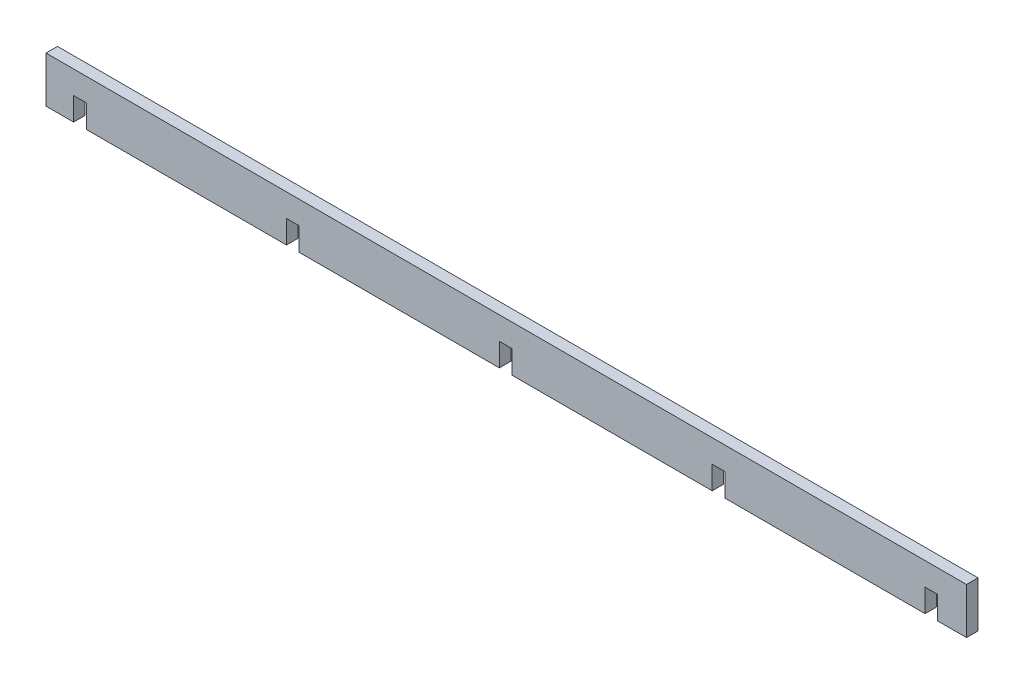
ISO-10303-21;
HEADER;
FILE_DESCRIPTION(('STEP AP214'),'2;1');
FILE_NAME('part.step','',(''),(''),'','','');
FILE_SCHEMA(('AUTOMOTIVE_DESIGN { 1 0 10303 214 1 1 1 1 }'));
ENDSEC;
DATA;
#1=APPLICATION_CONTEXT('core data for automotive mechanical design processes');
#2=APPLICATION_PROTOCOL_DEFINITION('international standard','automotive_design',2000,#1);
#3=PRODUCT_CONTEXT('',#1,'mechanical');
#4=PRODUCT('Part','Part','',(#3));
#5=PRODUCT_RELATED_PRODUCT_CATEGORY('part','',(#4));
#6=PRODUCT_DEFINITION_FORMATION('','',#4);
#7=PRODUCT_DEFINITION_CONTEXT('part definition',#1,'design');
#8=PRODUCT_DEFINITION('design','',#6,#7);
#9=PRODUCT_DEFINITION_SHAPE('','',#8);
#10=(LENGTH_UNIT() NAMED_UNIT(*) SI_UNIT(.MILLI.,.METRE.));
#11=(NAMED_UNIT(*) PLANE_ANGLE_UNIT() SI_UNIT($,.RADIAN.));
#12=(NAMED_UNIT(*) SI_UNIT($,.STERADIAN.) SOLID_ANGLE_UNIT());
#13=UNCERTAINTY_MEASURE_WITH_UNIT(LENGTH_MEASURE(1.E-05),#10,'distance_accuracy_value','');
#14=(GEOMETRIC_REPRESENTATION_CONTEXT(3) GLOBAL_UNCERTAINTY_ASSIGNED_CONTEXT((#13)) GLOBAL_UNIT_ASSIGNED_CONTEXT((#10,
#11,#12)) REPRESENTATION_CONTEXT('',''));
#15=CARTESIAN_POINT('',(0.,0.,0.));
#16=DIRECTION('',(0.,0.,1.));
#17=DIRECTION('',(1.,0.,0.));
#18=AXIS2_PLACEMENT_3D('',#15,#16,#17);
#19=CARTESIAN_POINT('',(0.,0.,10.));
#20=DIRECTION('',(0.,1.,0.));
#21=DIRECTION('',(0.,0.,1.));
#22=AXIS2_PLACEMENT_3D('',#19,#20,#21);
#23=PLANE('',#22);
#24=DIRECTION('',(0.,0.,-1.));
#25=VECTOR('',#24,1.);
#26=CARTESIAN_POINT('',(1180.,0.,10.001));
#27=LINE('',#26,#25);
#28=CARTESIAN_POINT('',(1180.,0.,10.));
#29=VERTEX_POINT('',#28);
#30=CARTESIAN_POINT('',(1180.,0.,-10.));
#31=VERTEX_POINT('',#30);
#32=EDGE_CURVE('E198',#29,#31,#27,.T.);
#33=ORIENTED_EDGE('',*,*,#32,.T.);
#34=DIRECTION('',(1.,0.,0.));
#35=VECTOR('',#34,1.);
#36=CARTESIAN_POINT('',(0.,0.,-10.));
#37=LINE('',#36,#35);
#38=CARTESIAN_POINT('',(1528.,0.,-10.));
#39=VERTEX_POINT('',#38);
#40=EDGE_CURVE('E212',#31,#39,#37,.T.);
#41=ORIENTED_EDGE('',*,*,#40,.T.);
#42=DIRECTION('',(0.,0.,-1.));
#43=VECTOR('',#42,1.);
#44=CARTESIAN_POINT('',(1528.,0.,10.001));
#45=LINE('',#44,#43);
#46=CARTESIAN_POINT('',(1528.,0.,10.));
#47=VERTEX_POINT('',#46);
#48=EDGE_CURVE('E316',#47,#39,#45,.T.);
#49=ORIENTED_EDGE('',*,*,#48,.F.);
#50=DIRECTION('',(1.,0.,0.));
#51=VECTOR('',#50,1.);
#52=CARTESIAN_POINT('',(0.,0.,10.));
#53=LINE('',#52,#51);
#54=EDGE_CURVE('E214',#29,#47,#53,.T.);
#55=ORIENTED_EDGE('',*,*,#54,.F.);
#56=EDGE_LOOP('',(#33,#41,#49,#55));
#57=FACE_BOUND('',#56,.T.);
#58=ADVANCED_FACE('F33',(#57),#23,.F.);
#59=DIRECTION('',(0.,0.,-1.));
#60=VECTOR('',#59,1.);
#61=CARTESIAN_POINT('',(1158.,0.,10.001));
#62=LINE('',#61,#60);
#63=CARTESIAN_POINT('',(1158.,0.,10.));
#64=VERTEX_POINT('',#63);
#65=CARTESIAN_POINT('',(1158.,0.,-10.));
#66=VERTEX_POINT('',#65);
#67=EDGE_CURVE('E48',#64,#66,#62,.T.);
#68=ORIENTED_EDGE('',*,*,#67,.F.);
#69=CARTESIAN_POINT('',(810.,0.,10.));
#70=VERTEX_POINT('',#69);
#71=EDGE_CURVE('E442',#70,#64,#53,.T.);
#72=ORIENTED_EDGE('',*,*,#71,.F.);
#73=DIRECTION('',(0.,0.,-1.));
#74=VECTOR('',#73,1.);
#75=CARTESIAN_POINT('',(810.,0.,10.001));
#76=LINE('',#75,#74);
#77=CARTESIAN_POINT('',(810.,0.,-10.));
#78=VERTEX_POINT('',#77);
#79=EDGE_CURVE('E276',#70,#78,#76,.T.);
#80=ORIENTED_EDGE('',*,*,#79,.T.);
#81=EDGE_CURVE('E222',#78,#66,#37,.T.);
#82=ORIENTED_EDGE('',*,*,#81,.T.);
#83=EDGE_LOOP('',(#68,#72,#80,#82));
#84=FACE_BOUND('',#83,.T.);
#85=ADVANCED_FACE('F419',(#84),#23,.F.);
#86=CARTESIAN_POINT('',(0.,0.,10.));
#87=DIRECTION('',(0.,0.,-1.));
#88=DIRECTION('',(-1.,0.,0.));
#89=AXIS2_PLACEMENT_3D('',#86,#87,#88);
#90=PLANE('',#89);
#91=DIRECTION('',(0.,-1.,0.));
#92=VECTOR('',#91,1.);
#93=CARTESIAN_POINT('',(1180.,0.,10.));
#94=LINE('',#93,#92);
#95=CARTESIAN_POINT('',(1180.,40.,10.));
#96=VERTEX_POINT('',#95);
#97=EDGE_CURVE('E449',#96,#29,#94,.T.);
#98=ORIENTED_EDGE('',*,*,#97,.T.);
#99=ORIENTED_EDGE('',*,*,#54,.T.);
#100=DIRECTION('',(0.,1.,0.));
#101=VECTOR('',#100,1.);
#102=CARTESIAN_POINT('',(1528.,0.,10.));
#103=LINE('',#102,#101);
#104=CARTESIAN_POINT('',(1528.,40.,10.));
#105=VERTEX_POINT('',#104);
#106=EDGE_CURVE('E325',#47,#105,#103,.T.);
#107=ORIENTED_EDGE('',*,*,#106,.T.);
#108=DIRECTION('',(1.,0.,0.));
#109=VECTOR('',#108,1.);
#110=CARTESIAN_POINT('',(1528.,40.,10.));
#111=LINE('',#110,#109);
#112=CARTESIAN_POINT('',(1550.,40.,10.));
#113=VERTEX_POINT('',#112);
#114=EDGE_CURVE('E310',#105,#113,#111,.T.);
#115=ORIENTED_EDGE('',*,*,#114,.T.);
#116=DIRECTION('',(0.,-1.,0.));
#117=VECTOR('',#116,1.);
#118=CARTESIAN_POINT('',(1550.,0.,10.));
#119=LINE('',#118,#117);
#120=CARTESIAN_POINT('',(1550.,0.,10.));
#121=VERTEX_POINT('',#120);
#122=EDGE_CURVE('E313',#113,#121,#119,.T.);
#123=ORIENTED_EDGE('',*,*,#122,.T.);
#124=CARTESIAN_POINT('',(1600.,0.,10.));
#125=VERTEX_POINT('',#124);
#126=EDGE_CURVE('E358',#121,#125,#53,.T.);
#127=ORIENTED_EDGE('',*,*,#126,.T.);
#128=DIRECTION('',(0.,1.,0.));
#129=VECTOR('',#128,1.);
#130=CARTESIAN_POINT('',(1600.,0.,10.));
#131=LINE('',#130,#129);
#132=CARTESIAN_POINT('',(1600.,80.,10.));
#133=VERTEX_POINT('',#132);
#134=EDGE_CURVE('E362',#125,#133,#131,.T.);
#135=ORIENTED_EDGE('',*,*,#134,.T.);
#136=DIRECTION('',(-1.,0.,0.));
#137=VECTOR('',#136,1.);
#138=CARTESIAN_POINT('',(0.,80.,10.));
#139=LINE('',#138,#137);
#140=CARTESIAN_POINT('',(0.,80.,10.));
#141=VERTEX_POINT('',#140);
#142=EDGE_CURVE('E365',#133,#141,#139,.T.);
#143=ORIENTED_EDGE('',*,*,#142,.T.);
#144=DIRECTION('',(0.,-1.,0.));
#145=VECTOR('',#144,1.);
#146=CARTESIAN_POINT('',(0.,0.,10.));
#147=LINE('',#146,#145);
#148=CARTESIAN_POINT('',(0.,0.,10.));
#149=VERTEX_POINT('',#148);
#150=EDGE_CURVE('E355',#141,#149,#147,.T.);
#151=ORIENTED_EDGE('',*,*,#150,.T.);
#152=CARTESIAN_POINT('',(48.0000000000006,0.,10.));
#153=VERTEX_POINT('',#152);
#154=EDGE_CURVE('E359',#149,#153,#53,.T.);
#155=ORIENTED_EDGE('',*,*,#154,.T.);
#156=DIRECTION('',(0.,1.,0.));
#157=VECTOR('',#156,1.);
#158=CARTESIAN_POINT('',(48.0000000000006,0.,10.));
#159=LINE('',#158,#157);
#160=CARTESIAN_POINT('',(48.0000000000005,40.,10.));
#161=VERTEX_POINT('',#160);
#162=EDGE_CURVE('E340',#153,#161,#159,.T.);
#163=ORIENTED_EDGE('',*,*,#162,.T.);
#164=DIRECTION('',(1.,0.,0.));
#165=VECTOR('',#164,1.);
#166=CARTESIAN_POINT('',(48.0000000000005,40.,10.));
#167=LINE('',#166,#165);
#168=CARTESIAN_POINT('',(70.0000000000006,40.,10.));
#169=VERTEX_POINT('',#168);
#170=EDGE_CURVE('E352',#161,#169,#167,.T.);
#171=ORIENTED_EDGE('',*,*,#170,.T.);
#172=DIRECTION('',(0.,-1.,0.));
#173=VECTOR('',#172,1.);
#174=CARTESIAN_POINT('',(70.0000000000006,0.,10.));
#175=LINE('',#174,#173);
#176=CARTESIAN_POINT('',(70.0000000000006,0.,10.));
#177=VERTEX_POINT('',#176);
#178=EDGE_CURVE('E337',#169,#177,#175,.T.);
#179=ORIENTED_EDGE('',*,*,#178,.T.);
#180=CARTESIAN_POINT('',(418.,0.,10.));
#181=VERTEX_POINT('',#180);
#182=EDGE_CURVE('E363',#177,#181,#53,.T.);
#183=ORIENTED_EDGE('',*,*,#182,.T.);
#184=DIRECTION('',(0.,1.,0.));
#185=VECTOR('',#184,1.);
#186=CARTESIAN_POINT('',(418.,0.,10.));
#187=LINE('',#186,#185);
#188=CARTESIAN_POINT('',(418.,40.,10.));
#189=VERTEX_POINT('',#188);
#190=EDGE_CURVE('E301',#181,#189,#187,.T.);
#191=ORIENTED_EDGE('',*,*,#190,.T.);
#192=DIRECTION('',(1.,0.,0.));
#193=VECTOR('',#192,1.);
#194=CARTESIAN_POINT('',(418.,40.,10.));
#195=LINE('',#194,#193);
#196=CARTESIAN_POINT('',(440.,40.,10.));
#197=VERTEX_POINT('',#196);
#198=EDGE_CURVE('E288',#189,#197,#195,.T.);
#199=ORIENTED_EDGE('',*,*,#198,.T.);
#200=DIRECTION('',(0.,-1.,0.));
#201=VECTOR('',#200,1.);
#202=CARTESIAN_POINT('',(440.,0.,10.));
#203=LINE('',#202,#201);
#204=CARTESIAN_POINT('',(440.,0.,10.));
#205=VERTEX_POINT('',#204);
#206=EDGE_CURVE('E291',#197,#205,#203,.T.);
#207=ORIENTED_EDGE('',*,*,#206,.T.);
#208=CARTESIAN_POINT('',(788.,0.,10.));
#209=VERTEX_POINT('',#208);
#210=EDGE_CURVE('E441',#205,#209,#53,.T.);
#211=ORIENTED_EDGE('',*,*,#210,.T.);
#212=DIRECTION('',(0.,1.,0.));
#213=VECTOR('',#212,1.);
#214=CARTESIAN_POINT('',(788.,0.,10.));
#215=LINE('',#214,#213);
#216=CARTESIAN_POINT('',(788.,40.,10.));
#217=VERTEX_POINT('',#216);
#218=EDGE_CURVE('E279',#209,#217,#215,.T.);
#219=ORIENTED_EDGE('',*,*,#218,.T.);
#220=DIRECTION('',(1.,0.,0.));
#221=VECTOR('',#220,1.);
#222=CARTESIAN_POINT('',(788.,40.,10.));
#223=LINE('',#222,#221);
#224=CARTESIAN_POINT('',(810.,40.,10.));
#225=VERTEX_POINT('',#224);
#226=EDGE_CURVE('E261',#217,#225,#223,.T.);
#227=ORIENTED_EDGE('',*,*,#226,.T.);
#228=DIRECTION('',(0.,-1.,0.));
#229=VECTOR('',#228,1.);
#230=CARTESIAN_POINT('',(810.,0.,10.));
#231=LINE('',#230,#229);
#232=EDGE_CURVE('E268',#225,#70,#231,.T.);
#233=ORIENTED_EDGE('',*,*,#232,.T.);
#234=ORIENTED_EDGE('',*,*,#71,.T.);
#235=DIRECTION('',(0.,1.,0.));
#236=VECTOR('',#235,1.);
#237=CARTESIAN_POINT('',(1158.,0.,10.));
#238=LINE('',#237,#236);
#239=CARTESIAN_POINT('',(1158.,40.,10.));
#240=VERTEX_POINT('',#239);
#241=EDGE_CURVE('E215',#64,#240,#238,.T.);
#242=ORIENTED_EDGE('',*,*,#241,.T.);
#243=DIRECTION('',(1.,0.,0.));
#244=VECTOR('',#243,1.);
#245=CARTESIAN_POINT('',(1158.,40.,10.));
#246=LINE('',#245,#244);
#247=EDGE_CURVE('E206',#240,#96,#246,.T.);
#248=ORIENTED_EDGE('',*,*,#247,.T.);
#249=EDGE_LOOP('',(#98,#99,#107,#115,#123,#127,#135,#143,#151,#155,#163,#171,#179,#183,#191,
#199,#207,#211,#219,#227,#233,#234,#242,#248));
#250=FACE_BOUND('',#249,.T.);
#251=ADVANCED_FACE('F378',(#250),#90,.F.);
#252=CARTESIAN_POINT('',(0.,0.,-10.));
#253=DIRECTION('',(0.,0.,-1.));
#254=DIRECTION('',(-1.,0.,0.));
#255=AXIS2_PLACEMENT_3D('',#252,#253,#254);
#256=PLANE('',#255);
#257=ORIENTED_EDGE('',*,*,#40,.F.);
#258=DIRECTION('',(0.,1.,0.));
#259=VECTOR('',#258,1.);
#260=CARTESIAN_POINT('',(1180.,0.,-10.));
#261=LINE('',#260,#259);
#262=CARTESIAN_POINT('',(1180.,40.,-10.));
#263=VERTEX_POINT('',#262);
#264=EDGE_CURVE('E195',#31,#263,#261,.T.);
#265=ORIENTED_EDGE('',*,*,#264,.T.);
#266=DIRECTION('',(-1.,0.,0.));
#267=VECTOR('',#266,1.);
#268=CARTESIAN_POINT('',(1158.,40.,-10.));
#269=LINE('',#268,#267);
#270=CARTESIAN_POINT('',(1158.,40.,-10.));
#271=VERTEX_POINT('',#270);
#272=EDGE_CURVE('E457',#263,#271,#269,.T.);
#273=ORIENTED_EDGE('',*,*,#272,.T.);
#274=DIRECTION('',(0.,-1.,0.));
#275=VECTOR('',#274,1.);
#276=CARTESIAN_POINT('',(1158.,0.,-10.));
#277=LINE('',#276,#275);
#278=EDGE_CURVE('E207',#271,#66,#277,.T.);
#279=ORIENTED_EDGE('',*,*,#278,.T.);
#280=ORIENTED_EDGE('',*,*,#81,.F.);
#281=DIRECTION('',(0.,1.,0.));
#282=VECTOR('',#281,1.);
#283=CARTESIAN_POINT('',(810.,0.,-10.));
#284=LINE('',#283,#282);
#285=CARTESIAN_POINT('',(810.,40.,-10.));
#286=VERTEX_POINT('',#285);
#287=EDGE_CURVE('E259',#78,#286,#284,.T.);
#288=ORIENTED_EDGE('',*,*,#287,.T.);
#289=DIRECTION('',(-1.,0.,0.));
#290=VECTOR('',#289,1.);
#291=CARTESIAN_POINT('',(788.,40.,-10.));
#292=LINE('',#291,#290);
#293=CARTESIAN_POINT('',(788.,40.,-10.));
#294=VERTEX_POINT('',#293);
#295=EDGE_CURVE('E257',#286,#294,#292,.T.);
#296=ORIENTED_EDGE('',*,*,#295,.T.);
#297=DIRECTION('',(0.,-1.,0.));
#298=VECTOR('',#297,1.);
#299=CARTESIAN_POINT('',(788.,0.,-10.));
#300=LINE('',#299,#298);
#301=CARTESIAN_POINT('',(788.,0.,-10.));
#302=VERTEX_POINT('',#301);
#303=EDGE_CURVE('E254',#294,#302,#300,.T.);
#304=ORIENTED_EDGE('',*,*,#303,.T.);
#305=CARTESIAN_POINT('',(440.,0.,-10.));
#306=VERTEX_POINT('',#305);
#307=EDGE_CURVE('E227',#306,#302,#37,.T.);
#308=ORIENTED_EDGE('',*,*,#307,.F.);
#309=DIRECTION('',(0.,1.,0.));
#310=VECTOR('',#309,1.);
#311=CARTESIAN_POINT('',(440.,0.,-10.));
#312=LINE('',#311,#310);
#313=CARTESIAN_POINT('',(440.,40.,-10.));
#314=VERTEX_POINT('',#313);
#315=EDGE_CURVE('E252',#306,#314,#312,.T.);
#316=ORIENTED_EDGE('',*,*,#315,.T.);
#317=DIRECTION('',(-1.,0.,0.));
#318=VECTOR('',#317,1.);
#319=CARTESIAN_POINT('',(418.,40.,-10.));
#320=LINE('',#319,#318);
#321=CARTESIAN_POINT('',(418.,40.,-10.));
#322=VERTEX_POINT('',#321);
#323=EDGE_CURVE('E282',#314,#322,#320,.T.);
#324=ORIENTED_EDGE('',*,*,#323,.T.);
#325=DIRECTION('',(0.,-1.,0.));
#326=VECTOR('',#325,1.);
#327=CARTESIAN_POINT('',(418.,0.,-10.));
#328=LINE('',#327,#326);
#329=CARTESIAN_POINT('',(418.,0.,-10.));
#330=VERTEX_POINT('',#329);
#331=EDGE_CURVE('E284',#322,#330,#328,.T.);
#332=ORIENTED_EDGE('',*,*,#331,.T.);
#333=CARTESIAN_POINT('',(70.0000000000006,0.,-10.));
#334=VERTEX_POINT('',#333);
#335=EDGE_CURVE('E229',#334,#330,#37,.T.);
#336=ORIENTED_EDGE('',*,*,#335,.F.);
#337=DIRECTION('',(0.,1.,0.));
#338=VECTOR('',#337,1.);
#339=CARTESIAN_POINT('',(70.0000000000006,0.,-10.));
#340=LINE('',#339,#338);
#341=CARTESIAN_POINT('',(70.0000000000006,40.,-10.));
#342=VERTEX_POINT('',#341);
#343=EDGE_CURVE('E328',#334,#342,#340,.T.);
#344=ORIENTED_EDGE('',*,*,#343,.T.);
#345=DIRECTION('',(-1.,0.,0.));
#346=VECTOR('',#345,1.);
#347=CARTESIAN_POINT('',(48.0000000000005,40.,-10.));
#348=LINE('',#347,#346);
#349=CARTESIAN_POINT('',(48.0000000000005,40.,-10.));
#350=VERTEX_POINT('',#349);
#351=EDGE_CURVE('E331',#342,#350,#348,.T.);
#352=ORIENTED_EDGE('',*,*,#351,.T.);
#353=DIRECTION('',(0.,-1.,0.));
#354=VECTOR('',#353,1.);
#355=CARTESIAN_POINT('',(48.0000000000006,0.,-10.));
#356=LINE('',#355,#354);
#357=CARTESIAN_POINT('',(48.0000000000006,0.,-10.));
#358=VERTEX_POINT('',#357);
#359=EDGE_CURVE('E334',#350,#358,#356,.T.);
#360=ORIENTED_EDGE('',*,*,#359,.T.);
#361=CARTESIAN_POINT('',(0.,0.,-10.));
#362=VERTEX_POINT('',#361);
#363=EDGE_CURVE('E225',#362,#358,#37,.T.);
#364=ORIENTED_EDGE('',*,*,#363,.F.);
#365=DIRECTION('',(0.,-1.,0.));
#366=VECTOR('',#365,1.);
#367=CARTESIAN_POINT('',(0.,0.,-10.));
#368=LINE('',#367,#366);
#369=CARTESIAN_POINT('',(0.,80.,-10.));
#370=VERTEX_POINT('',#369);
#371=EDGE_CURVE('E228',#370,#362,#368,.T.);
#372=ORIENTED_EDGE('',*,*,#371,.F.);
#373=DIRECTION('',(-1.,0.,0.));
#374=VECTOR('',#373,1.);
#375=CARTESIAN_POINT('',(0.,80.,-10.));
#376=LINE('',#375,#374);
#377=CARTESIAN_POINT('',(1600.,80.,-10.));
#378=VERTEX_POINT('',#377);
#379=EDGE_CURVE('E236',#378,#370,#376,.T.);
#380=ORIENTED_EDGE('',*,*,#379,.F.);
#381=DIRECTION('',(0.,1.,0.));
#382=VECTOR('',#381,1.);
#383=CARTESIAN_POINT('',(1600.,0.,-10.));
#384=LINE('',#383,#382);
#385=CARTESIAN_POINT('',(1600.,0.,-10.));
#386=VERTEX_POINT('',#385);
#387=EDGE_CURVE('E233',#386,#378,#384,.T.);
#388=ORIENTED_EDGE('',*,*,#387,.F.);
#389=CARTESIAN_POINT('',(1550.,0.,-10.));
#390=VERTEX_POINT('',#389);
#391=EDGE_CURVE('E223',#390,#386,#37,.T.);
#392=ORIENTED_EDGE('',*,*,#391,.F.);
#393=DIRECTION('',(0.,1.,0.));
#394=VECTOR('',#393,1.);
#395=CARTESIAN_POINT('',(1550.,0.,-10.));
#396=LINE('',#395,#394);
#397=CARTESIAN_POINT('',(1550.,40.,-10.));
#398=VERTEX_POINT('',#397);
#399=EDGE_CURVE('E307',#390,#398,#396,.T.);
#400=ORIENTED_EDGE('',*,*,#399,.T.);
#401=DIRECTION('',(-1.,0.,0.));
#402=VECTOR('',#401,1.);
#403=CARTESIAN_POINT('',(1528.,40.,-10.));
#404=LINE('',#403,#402);
#405=CARTESIAN_POINT('',(1528.,40.,-10.));
#406=VERTEX_POINT('',#405);
#407=EDGE_CURVE('E304',#398,#406,#404,.T.);
#408=ORIENTED_EDGE('',*,*,#407,.T.);
#409=DIRECTION('',(0.,-1.,0.));
#410=VECTOR('',#409,1.);
#411=CARTESIAN_POINT('',(1528.,0.,-10.));
#412=LINE('',#411,#410);
#413=EDGE_CURVE('E221',#406,#39,#412,.T.);
#414=ORIENTED_EDGE('',*,*,#413,.T.);
#415=EDGE_LOOP('',(#257,#265,#273,#279,#280,#288,#296,#304,#308,#316,#324,#332,#336,#344,#352,
#360,#364,#372,#380,#388,#392,#400,#408,#414));
#416=FACE_BOUND('',#415,.T.);
#417=ADVANCED_FACE('F218',(#416),#256,.T.);
#418=DIRECTION('',(0.,0.,-1.));
#419=VECTOR('',#418,1.);
#420=CARTESIAN_POINT('',(788.,0.,10.001));
#421=LINE('',#420,#419);
#422=EDGE_CURVE('E56',#209,#302,#421,.T.);
#423=ORIENTED_EDGE('',*,*,#422,.F.);
#424=ORIENTED_EDGE('',*,*,#210,.F.);
#425=DIRECTION('',(0.,0.,-1.));
#426=VECTOR('',#425,1.);
#427=CARTESIAN_POINT('',(440.,0.,10.001));
#428=LINE('',#427,#426);
#429=EDGE_CURVE('E249',#205,#306,#428,.T.);
#430=ORIENTED_EDGE('',*,*,#429,.T.);
#431=ORIENTED_EDGE('',*,*,#307,.T.);
#432=EDGE_LOOP('',(#423,#424,#430,#431));
#433=FACE_BOUND('',#432,.T.);
#434=ADVANCED_FACE('F246',(#433),#23,.F.);
#435=DIRECTION('',(0.,0.,-1.));
#436=VECTOR('',#435,1.);
#437=CARTESIAN_POINT('',(418.,0.,10.001));
#438=LINE('',#437,#436);
#439=EDGE_CURVE('E294',#181,#330,#438,.T.);
#440=ORIENTED_EDGE('',*,*,#439,.F.);
#441=ORIENTED_EDGE('',*,*,#182,.F.);
#442=DIRECTION('',(0.,0.,-1.));
#443=VECTOR('',#442,1.);
#444=CARTESIAN_POINT('',(70.0000000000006,0.,10.001));
#445=LINE('',#444,#443);
#446=EDGE_CURVE('E348',#177,#334,#445,.T.);
#447=ORIENTED_EDGE('',*,*,#446,.T.);
#448=ORIENTED_EDGE('',*,*,#335,.T.);
#449=EDGE_LOOP('',(#440,#441,#447,#448));
#450=FACE_BOUND('',#449,.T.);
#451=ADVANCED_FACE('F430',(#450),#23,.F.);
#452=DIRECTION('',(0.,0.,-1.));
#453=VECTOR('',#452,1.);
#454=CARTESIAN_POINT('',(1550.,0.,10.001));
#455=LINE('',#454,#453);
#456=EDGE_CURVE('E322',#121,#390,#455,.T.);
#457=ORIENTED_EDGE('',*,*,#456,.T.);
#458=ORIENTED_EDGE('',*,*,#391,.T.);
#459=DIRECTION('',(0.,0.,-1.));
#460=VECTOR('',#459,1.);
#461=CARTESIAN_POINT('',(1600.,0.,10.));
#462=LINE('',#461,#460);
#463=EDGE_CURVE('E41',#125,#386,#462,.T.);
#464=ORIENTED_EDGE('',*,*,#463,.F.);
#465=ORIENTED_EDGE('',*,*,#126,.F.);
#466=EDGE_LOOP('',(#457,#458,#464,#465));
#467=FACE_BOUND('',#466,.T.);
#468=ADVANCED_FACE('F396',(#467),#23,.F.);
#469=DIRECTION('',(0.,0.,-1.));
#470=VECTOR('',#469,1.);
#471=CARTESIAN_POINT('',(48.0000000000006,0.,10.001));
#472=LINE('',#471,#470);
#473=EDGE_CURVE('E350',#153,#358,#472,.T.);
#474=ORIENTED_EDGE('',*,*,#473,.F.);
#475=ORIENTED_EDGE('',*,*,#154,.F.);
#476=DIRECTION('',(0.,0.,-1.));
#477=VECTOR('',#476,1.);
#478=CARTESIAN_POINT('',(0.,0.,10.));
#479=LINE('',#478,#477);
#480=EDGE_CURVE('E11',#149,#362,#479,.T.);
#481=ORIENTED_EDGE('',*,*,#480,.T.);
#482=ORIENTED_EDGE('',*,*,#363,.T.);
#483=EDGE_LOOP('',(#474,#475,#481,#482));
#484=FACE_BOUND('',#483,.T.);
#485=ADVANCED_FACE('F376',(#484),#23,.F.);
#486=CARTESIAN_POINT('',(0.,0.,10.));
#487=DIRECTION('',(1.,0.,0.));
#488=DIRECTION('',(0.,0.,-1.));
#489=AXIS2_PLACEMENT_3D('',#486,#487,#488);
#490=PLANE('',#489);
#491=ORIENTED_EDGE('',*,*,#371,.T.);
#492=ORIENTED_EDGE('',*,*,#480,.F.);
#493=ORIENTED_EDGE('',*,*,#150,.F.);
#494=DIRECTION('',(0.,0.,-1.));
#495=VECTOR('',#494,1.);
#496=CARTESIAN_POINT('',(0.,80.,10.));
#497=LINE('',#496,#495);
#498=EDGE_CURVE('E366',#141,#370,#497,.T.);
#499=ORIENTED_EDGE('',*,*,#498,.T.);
#500=EDGE_LOOP('',(#491,#492,#493,#499));
#501=FACE_BOUND('',#500,.T.);
#502=ADVANCED_FACE('F35',(#501),#490,.F.);
#503=CARTESIAN_POINT('',(1600.,0.,10.));
#504=DIRECTION('',(-1.,0.,0.));
#505=DIRECTION('',(0.,0.,1.));
#506=AXIS2_PLACEMENT_3D('',#503,#504,#505);
#507=PLANE('',#506);
#508=ORIENTED_EDGE('',*,*,#387,.T.);
#509=DIRECTION('',(0.,0.,-1.));
#510=VECTOR('',#509,1.);
#511=CARTESIAN_POINT('',(1600.,80.,10.));
#512=LINE('',#511,#510);
#513=EDGE_CURVE('E385',#133,#378,#512,.T.);
#514=ORIENTED_EDGE('',*,*,#513,.F.);
#515=ORIENTED_EDGE('',*,*,#134,.F.);
#516=ORIENTED_EDGE('',*,*,#463,.T.);
#517=EDGE_LOOP('',(#508,#514,#515,#516));
#518=FACE_BOUND('',#517,.T.);
#519=ADVANCED_FACE('F392',(#518),#507,.F.);
#520=CARTESIAN_POINT('',(0.,80.,10.));
#521=DIRECTION('',(0.,-1.,0.));
#522=DIRECTION('',(0.,0.,-1.));
#523=AXIS2_PLACEMENT_3D('',#520,#521,#522);
#524=PLANE('',#523);
#525=ORIENTED_EDGE('',*,*,#379,.T.);
#526=ORIENTED_EDGE('',*,*,#498,.F.);
#527=ORIENTED_EDGE('',*,*,#142,.F.);
#528=ORIENTED_EDGE('',*,*,#513,.T.);
#529=EDGE_LOOP('',(#525,#526,#527,#528));
#530=FACE_BOUND('',#529,.T.);
#531=ADVANCED_FACE('F384',(#530),#524,.F.);
#532=CARTESIAN_POINT('',(48.0000000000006,0.,10.001));
#533=DIRECTION('',(1.,0.,0.));
#534=DIRECTION('',(0.,1.,0.));
#535=AXIS2_PLACEMENT_3D('',#532,#533,#534);
#536=PLANE('',#535);
#537=ORIENTED_EDGE('',*,*,#473,.T.);
#538=ORIENTED_EDGE('',*,*,#359,.F.);
#539=DIRECTION('',(0.,0.,-1.));
#540=VECTOR('',#539,1.);
#541=CARTESIAN_POINT('',(48.0000000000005,40.,10.001));
#542=LINE('',#541,#540);
#543=EDGE_CURVE('E343',#161,#350,#542,.T.);
#544=ORIENTED_EDGE('',*,*,#543,.F.);
#545=ORIENTED_EDGE('',*,*,#162,.F.);
#546=EDGE_LOOP('',(#537,#538,#544,#545));
#547=FACE_BOUND('',#546,.T.);
#548=ADVANCED_FACE('F500',(#547),#536,.T.);
#549=CARTESIAN_POINT('',(70.0000000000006,0.,10.001));
#550=DIRECTION('',(-1.,0.,0.));
#551=DIRECTION('',(0.,0.,1.));
#552=AXIS2_PLACEMENT_3D('',#549,#550,#551);
#553=PLANE('',#552);
#554=DIRECTION('',(0.,0.,-1.));
#555=VECTOR('',#554,1.);
#556=CARTESIAN_POINT('',(70.0000000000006,40.,10.001));
#557=LINE('',#556,#555);
#558=EDGE_CURVE('E346',#169,#342,#557,.T.);
#559=ORIENTED_EDGE('',*,*,#558,.T.);
#560=ORIENTED_EDGE('',*,*,#343,.F.);
#561=ORIENTED_EDGE('',*,*,#446,.F.);
#562=ORIENTED_EDGE('',*,*,#178,.F.);
#563=EDGE_LOOP('',(#559,#560,#561,#562));
#564=FACE_BOUND('',#563,.T.);
#565=ADVANCED_FACE('F494',(#564),#553,.T.);
#566=CARTESIAN_POINT('',(48.0000000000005,40.,10.001));
#567=DIRECTION('',(0.,-1.,0.));
#568=DIRECTION('',(0.,0.,-1.));
#569=AXIS2_PLACEMENT_3D('',#566,#567,#568);
#570=PLANE('',#569);
#571=ORIENTED_EDGE('',*,*,#543,.T.);
#572=ORIENTED_EDGE('',*,*,#351,.F.);
#573=ORIENTED_EDGE('',*,*,#558,.F.);
#574=ORIENTED_EDGE('',*,*,#170,.F.);
#575=EDGE_LOOP('',(#571,#572,#573,#574));
#576=FACE_BOUND('',#575,.T.);
#577=ADVANCED_FACE('F497',(#576),#570,.T.);
#578=CARTESIAN_POINT('',(1550.,0.,10.001));
#579=DIRECTION('',(-1.,0.,0.));
#580=DIRECTION('',(0.,0.,1.));
#581=AXIS2_PLACEMENT_3D('',#578,#579,#580);
#582=PLANE('',#581);
#583=DIRECTION('',(0.,0.,-1.));
#584=VECTOR('',#583,1.);
#585=CARTESIAN_POINT('',(1550.,40.,10.001));
#586=LINE('',#585,#584);
#587=EDGE_CURVE('E320',#113,#398,#586,.T.);
#588=ORIENTED_EDGE('',*,*,#587,.T.);
#589=ORIENTED_EDGE('',*,*,#399,.F.);
#590=ORIENTED_EDGE('',*,*,#456,.F.);
#591=ORIENTED_EDGE('',*,*,#122,.F.);
#592=EDGE_LOOP('',(#588,#589,#590,#591));
#593=FACE_BOUND('',#592,.T.);
#594=ADVANCED_FACE('F398',(#593),#582,.T.);
#595=CARTESIAN_POINT('',(1528.,40.,10.001));
#596=DIRECTION('',(0.,-1.,0.));
#597=DIRECTION('',(0.,0.,-1.));
#598=AXIS2_PLACEMENT_3D('',#595,#596,#597);
#599=PLANE('',#598);
#600=DIRECTION('',(0.,0.,-1.));
#601=VECTOR('',#600,1.);
#602=CARTESIAN_POINT('',(1528.,40.,10.001));
#603=LINE('',#602,#601);
#604=EDGE_CURVE('E318',#105,#406,#603,.T.);
#605=ORIENTED_EDGE('',*,*,#604,.T.);
#606=ORIENTED_EDGE('',*,*,#407,.F.);
#607=ORIENTED_EDGE('',*,*,#587,.F.);
#608=ORIENTED_EDGE('',*,*,#114,.F.);
#609=EDGE_LOOP('',(#605,#606,#607,#608));
#610=FACE_BOUND('',#609,.T.);
#611=ADVANCED_FACE('F403',(#610),#599,.T.);
#612=CARTESIAN_POINT('',(1528.,0.,10.001));
#613=DIRECTION('',(1.,0.,0.));
#614=DIRECTION('',(0.,1.,0.));
#615=AXIS2_PLACEMENT_3D('',#612,#613,#614);
#616=PLANE('',#615);
#617=ORIENTED_EDGE('',*,*,#48,.T.);
#618=ORIENTED_EDGE('',*,*,#413,.F.);
#619=ORIENTED_EDGE('',*,*,#604,.F.);
#620=ORIENTED_EDGE('',*,*,#106,.F.);
#621=EDGE_LOOP('',(#617,#618,#619,#620));
#622=FACE_BOUND('',#621,.T.);
#623=ADVANCED_FACE('F406',(#622),#616,.T.);
#624=CARTESIAN_POINT('',(440.,0.,10.001));
#625=DIRECTION('',(-1.,0.,0.));
#626=DIRECTION('',(0.,0.,1.));
#627=AXIS2_PLACEMENT_3D('',#624,#625,#626);
#628=PLANE('',#627);
#629=DIRECTION('',(0.,0.,-1.));
#630=VECTOR('',#629,1.);
#631=CARTESIAN_POINT('',(440.,40.,10.001));
#632=LINE('',#631,#630);
#633=EDGE_CURVE('E298',#197,#314,#632,.T.);
#634=ORIENTED_EDGE('',*,*,#633,.T.);
#635=ORIENTED_EDGE('',*,*,#315,.F.);
#636=ORIENTED_EDGE('',*,*,#429,.F.);
#637=ORIENTED_EDGE('',*,*,#206,.F.);
#638=EDGE_LOOP('',(#634,#635,#636,#637));
#639=FACE_BOUND('',#638,.T.);
#640=ADVANCED_FACE('F408',(#639),#628,.T.);
#641=CARTESIAN_POINT('',(418.,40.,10.001));
#642=DIRECTION('',(0.,-1.,0.));
#643=DIRECTION('',(0.,0.,-1.));
#644=AXIS2_PLACEMENT_3D('',#641,#642,#643);
#645=PLANE('',#644);
#646=DIRECTION('',(0.,0.,-1.));
#647=VECTOR('',#646,1.);
#648=CARTESIAN_POINT('',(418.,40.,10.001));
#649=LINE('',#648,#647);
#650=EDGE_CURVE('E296',#189,#322,#649,.T.);
#651=ORIENTED_EDGE('',*,*,#650,.T.);
#652=ORIENTED_EDGE('',*,*,#323,.F.);
#653=ORIENTED_EDGE('',*,*,#633,.F.);
#654=ORIENTED_EDGE('',*,*,#198,.F.);
#655=EDGE_LOOP('',(#651,#652,#653,#654));
#656=FACE_BOUND('',#655,.T.);
#657=ADVANCED_FACE('F414',(#656),#645,.T.);
#658=CARTESIAN_POINT('',(418.,0.,10.001));
#659=DIRECTION('',(1.,0.,0.));
#660=DIRECTION('',(0.,0.,-1.));
#661=AXIS2_PLACEMENT_3D('',#658,#659,#660);
#662=PLANE('',#661);
#663=ORIENTED_EDGE('',*,*,#439,.T.);
#664=ORIENTED_EDGE('',*,*,#331,.F.);
#665=ORIENTED_EDGE('',*,*,#650,.F.);
#666=ORIENTED_EDGE('',*,*,#190,.F.);
#667=EDGE_LOOP('',(#663,#664,#665,#666));
#668=FACE_BOUND('',#667,.T.);
#669=ADVANCED_FACE('F481',(#668),#662,.T.);
#670=CARTESIAN_POINT('',(810.,0.,10.001));
#671=DIRECTION('',(-1.,0.,0.));
#672=DIRECTION('',(0.,0.,1.));
#673=AXIS2_PLACEMENT_3D('',#670,#671,#672);
#674=PLANE('',#673);
#675=DIRECTION('',(0.,0.,-1.));
#676=VECTOR('',#675,1.);
#677=CARTESIAN_POINT('',(810.,40.,10.001));
#678=LINE('',#677,#676);
#679=EDGE_CURVE('E274',#225,#286,#678,.T.);
#680=ORIENTED_EDGE('',*,*,#679,.T.);
#681=ORIENTED_EDGE('',*,*,#287,.F.);
#682=ORIENTED_EDGE('',*,*,#79,.F.);
#683=ORIENTED_EDGE('',*,*,#232,.F.);
#684=EDGE_LOOP('',(#680,#681,#682,#683));
#685=FACE_BOUND('',#684,.T.);
#686=ADVANCED_FACE('F477',(#685),#674,.T.);
#687=CARTESIAN_POINT('',(788.,40.,10.001));
#688=DIRECTION('',(0.,-1.,0.));
#689=DIRECTION('',(0.,0.,-1.));
#690=AXIS2_PLACEMENT_3D('',#687,#688,#689);
#691=PLANE('',#690);
#692=DIRECTION('',(0.,0.,-1.));
#693=VECTOR('',#692,1.);
#694=CARTESIAN_POINT('',(788.,40.,10.001));
#695=LINE('',#694,#693);
#696=EDGE_CURVE('E272',#217,#294,#695,.T.);
#697=ORIENTED_EDGE('',*,*,#696,.T.);
#698=ORIENTED_EDGE('',*,*,#295,.F.);
#699=ORIENTED_EDGE('',*,*,#679,.F.);
#700=ORIENTED_EDGE('',*,*,#226,.F.);
#701=EDGE_LOOP('',(#697,#698,#699,#700));
#702=FACE_BOUND('',#701,.T.);
#703=ADVANCED_FACE('F474',(#702),#691,.T.);
#704=CARTESIAN_POINT('',(788.,0.,10.001));
#705=DIRECTION('',(1.,0.,0.));
#706=DIRECTION('',(0.,0.,-1.));
#707=AXIS2_PLACEMENT_3D('',#704,#705,#706);
#708=PLANE('',#707);
#709=ORIENTED_EDGE('',*,*,#422,.T.);
#710=ORIENTED_EDGE('',*,*,#303,.F.);
#711=ORIENTED_EDGE('',*,*,#696,.F.);
#712=ORIENTED_EDGE('',*,*,#218,.F.);
#713=EDGE_LOOP('',(#709,#710,#711,#712));
#714=FACE_BOUND('',#713,.T.);
#715=ADVANCED_FACE('F471',(#714),#708,.T.);
#716=CARTESIAN_POINT('',(1180.,0.,10.001));
#717=DIRECTION('',(-1.,0.,0.));
#718=DIRECTION('',(0.,0.,1.));
#719=AXIS2_PLACEMENT_3D('',#716,#717,#718);
#720=PLANE('',#719);
#721=DIRECTION('',(0.,0.,-1.));
#722=VECTOR('',#721,1.);
#723=CARTESIAN_POINT('',(1180.,40.,10.001));
#724=LINE('',#723,#722);
#725=EDGE_CURVE('E201',#96,#263,#724,.T.);
#726=ORIENTED_EDGE('',*,*,#725,.T.);
#727=ORIENTED_EDGE('',*,*,#264,.F.);
#728=ORIENTED_EDGE('',*,*,#32,.F.);
#729=ORIENTED_EDGE('',*,*,#97,.F.);
#730=EDGE_LOOP('',(#726,#727,#728,#729));
#731=FACE_BOUND('',#730,.T.);
#732=ADVANCED_FACE('F197',(#731),#720,.T.);
#733=CARTESIAN_POINT('',(1158.,40.,10.001));
#734=DIRECTION('',(0.,-1.,0.));
#735=DIRECTION('',(0.,0.,-1.));
#736=AXIS2_PLACEMENT_3D('',#733,#734,#735);
#737=PLANE('',#736);
#738=DIRECTION('',(0.,0.,-1.));
#739=VECTOR('',#738,1.);
#740=CARTESIAN_POINT('',(1158.,40.,10.001));
#741=LINE('',#740,#739);
#742=EDGE_CURVE('E448',#240,#271,#741,.T.);
#743=ORIENTED_EDGE('',*,*,#742,.T.);
#744=ORIENTED_EDGE('',*,*,#272,.F.);
#745=ORIENTED_EDGE('',*,*,#725,.F.);
#746=ORIENTED_EDGE('',*,*,#247,.F.);
#747=EDGE_LOOP('',(#743,#744,#745,#746));
#748=FACE_BOUND('',#747,.T.);
#749=ADVANCED_FACE('F459',(#748),#737,.T.);
#750=CARTESIAN_POINT('',(1158.,0.,10.001));
#751=DIRECTION('',(1.,0.,0.));
#752=DIRECTION('',(0.,1.,0.));
#753=AXIS2_PLACEMENT_3D('',#750,#751,#752);
#754=PLANE('',#753);
#755=ORIENTED_EDGE('',*,*,#67,.T.);
#756=ORIENTED_EDGE('',*,*,#278,.F.);
#757=ORIENTED_EDGE('',*,*,#742,.F.);
#758=ORIENTED_EDGE('',*,*,#241,.F.);
#759=EDGE_LOOP('',(#755,#756,#757,#758));
#760=FACE_BOUND('',#759,.T.);
#761=ADVANCED_FACE('F461',(#760),#754,.T.);
#762=CLOSED_SHELL('',(#58,#85,#251,#417,#434,#451,#468,#485,#502,#519,#531,#548,#565,#577,#594,
#611,#623,#640,#657,#669,#686,#703,#715,#732,#749,#761));
#763=MANIFOLD_SOLID_BREP('B2',#762);
#764=ADVANCED_BREP_SHAPE_REPRESENTATION('',(#18,#763),#14);
#765=SHAPE_DEFINITION_REPRESENTATION(#9,#764);
ENDSEC;
END-ISO-10303-21;
